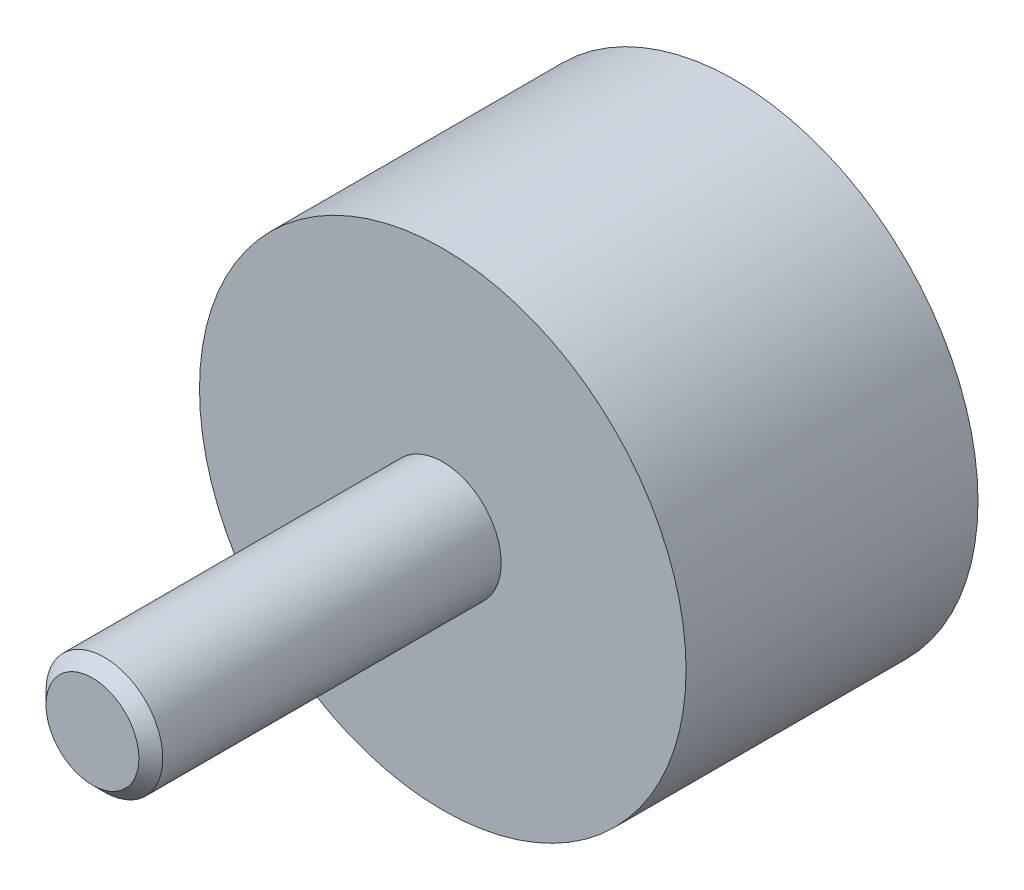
ISO-10303-21;
HEADER;
FILE_DESCRIPTION(('STEP AP214'),'2;1');
FILE_NAME('part.step','',(''),(''),'','','');
FILE_SCHEMA(('AUTOMOTIVE_DESIGN { 1 0 10303 214 1 1 1 1 }'));
ENDSEC;
DATA;
#1=APPLICATION_CONTEXT('core data for automotive mechanical design processes');
#2=APPLICATION_PROTOCOL_DEFINITION('international standard','automotive_design',2000,#1);
#3=PRODUCT_CONTEXT('',#1,'mechanical');
#4=PRODUCT('Part','Part','',(#3));
#5=PRODUCT_RELATED_PRODUCT_CATEGORY('part','',(#4));
#6=PRODUCT_DEFINITION_FORMATION('','',#4);
#7=PRODUCT_DEFINITION_CONTEXT('part definition',#1,'design');
#8=PRODUCT_DEFINITION('design','',#6,#7);
#9=PRODUCT_DEFINITION_SHAPE('','',#8);
#10=(LENGTH_UNIT() NAMED_UNIT(*) SI_UNIT(.MILLI.,.METRE.));
#11=(NAMED_UNIT(*) PLANE_ANGLE_UNIT() SI_UNIT($,.RADIAN.));
#12=(NAMED_UNIT(*) SI_UNIT($,.STERADIAN.) SOLID_ANGLE_UNIT());
#13=UNCERTAINTY_MEASURE_WITH_UNIT(LENGTH_MEASURE(1.E-05),#10,'distance_accuracy_value','');
#14=(GEOMETRIC_REPRESENTATION_CONTEXT(3) GLOBAL_UNCERTAINTY_ASSIGNED_CONTEXT((#13)) GLOBAL_UNIT_ASSIGNED_CONTEXT((#10,
#11,#12)) REPRESENTATION_CONTEXT('',''));
#15=CARTESIAN_POINT('',(0.,0.,0.));
#16=DIRECTION('',(0.,0.,1.));
#17=DIRECTION('',(1.,0.,0.));
#18=AXIS2_PLACEMENT_3D('',#15,#16,#17);
#19=CARTESIAN_POINT('',(11.666666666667,0.,15.));
#20=DIRECTION('',(0.,0.,1.));
#21=DIRECTION('',(0.,-1.,0.));
#22=AXIS2_PLACEMENT_3D('',#19,#20,#21);
#23=PLANE('',#22);
#24=CARTESIAN_POINT('',(0.,0.,15.));
#25=DIRECTION('',(0.,0.,1.));
#26=DIRECTION('',(0.,-1.,0.));
#27=AXIS2_PLACEMENT_3D('',#24,#25,#26);
#28=CIRCLE('',#27,3.);
#29=CARTESIAN_POINT('',(0.,-3.,15.));
#30=VERTEX_POINT('',#29);
#31=EDGE_CURVE('E23',#30,#30,#28,.T.);
#32=ORIENTED_EDGE('',*,*,#31,.F.);
#33=EDGE_LOOP('',(#32));
#34=FACE_BOUND('',#33,.T.);
#35=CARTESIAN_POINT('',(0.,0.,15.));
#36=DIRECTION('',(0.,0.,1.));
#37=DIRECTION('',(0.,-1.,0.));
#38=AXIS2_PLACEMENT_3D('',#35,#36,#37);
#39=CIRCLE('',#38,12.5);
#40=CARTESIAN_POINT('',(0.,-12.5,15.));
#41=VERTEX_POINT('',#40);
#42=EDGE_CURVE('E27',#41,#41,#39,.T.);
#43=ORIENTED_EDGE('',*,*,#42,.T.);
#44=EDGE_LOOP('',(#43));
#45=FACE_BOUND('',#44,.T.);
#46=ADVANCED_FACE('F12',(#34,#45),#23,.T.);
#47=CARTESIAN_POINT('',(0.,0.,0.5));
#48=DIRECTION('',(0.,0.,1.));
#49=DIRECTION('',(0.,-1.,0.));
#50=AXIS2_PLACEMENT_3D('',#47,#48,#49);
#51=CYLINDRICAL_SURFACE('',#50,12.5);
#52=CARTESIAN_POINT('',(0.,0.,0.));
#53=DIRECTION('',(0.,0.,1.));
#54=DIRECTION('',(0.,-1.,0.));
#55=AXIS2_PLACEMENT_3D('',#52,#53,#54);
#56=CIRCLE('',#55,12.5);
#57=CARTESIAN_POINT('',(0.,-12.5,0.));
#58=VERTEX_POINT('',#57);
#59=EDGE_CURVE('E32',#58,#58,#56,.T.);
#60=ORIENTED_EDGE('',*,*,#59,.T.);
#61=EDGE_LOOP('',(#60));
#62=FACE_BOUND('',#61,.T.);
#63=ORIENTED_EDGE('',*,*,#42,.F.);
#64=EDGE_LOOP('',(#63));
#65=FACE_BOUND('',#64,.T.);
#66=ADVANCED_FACE('F63',(#62,#65),#51,.T.);
#67=CARTESIAN_POINT('',(12.5,0.,0.));
#68=DIRECTION('',(0.,0.,-1.));
#69=DIRECTION('',(0.,1.,0.));
#70=AXIS2_PLACEMENT_3D('',#67,#68,#69);
#71=PLANE('',#70);
#72=CARTESIAN_POINT('',(0.,0.,0.));
#73=DIRECTION('',(0.,0.,-1.));
#74=DIRECTION('',(0.,1.,0.));
#75=AXIS2_PLACEMENT_3D('',#72,#73,#74);
#76=CIRCLE('',#75,3.45);
#77=CARTESIAN_POINT('',(0.,3.45,0.));
#78=VERTEX_POINT('',#77);
#79=EDGE_CURVE('E8',#78,#78,#76,.F.);
#80=ORIENTED_EDGE('',*,*,#79,.T.);
#81=EDGE_LOOP('',(#80));
#82=FACE_BOUND('',#81,.T.);
#83=ORIENTED_EDGE('',*,*,#59,.F.);
#84=EDGE_LOOP('',(#83));
#85=FACE_BOUND('',#84,.T.);
#86=ADVANCED_FACE('F68',(#82,#85),#71,.T.);
#87=CARTESIAN_POINT('',(0.,0.,33.));
#88=DIRECTION('',(0.,0.,1.));
#89=DIRECTION('',(0.,-1.,0.));
#90=AXIS2_PLACEMENT_3D('',#87,#88,#89);
#91=PLANE('',#90);
#92=CARTESIAN_POINT('',(0.,0.,33.));
#93=DIRECTION('',(0.,0.,1.));
#94=DIRECTION('',(0.,-1.,0.));
#95=AXIS2_PLACEMENT_3D('',#92,#93,#94);
#96=CIRCLE('',#95,2.3865);
#97=CARTESIAN_POINT('',(0.,-2.3865,33.));
#98=VERTEX_POINT('',#97);
#99=EDGE_CURVE('E35',#98,#98,#96,.T.);
#100=ORIENTED_EDGE('',*,*,#99,.T.);
#101=EDGE_LOOP('',(#100));
#102=FACE_BOUND('',#101,.T.);
#103=ADVANCED_FACE('F74',(#102),#91,.T.);
#104=CARTESIAN_POINT('',(0.,0.,33.));
#105=DIRECTION('',(0.,0.,-1.));
#106=DIRECTION('',(0.,1.,0.));
#107=AXIS2_PLACEMENT_3D('',#104,#105,#106);
#108=CONICAL_SURFACE('',#107,2.3865,0.785398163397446);
#109=CARTESIAN_POINT('',(0.,0.,32.3865));
#110=DIRECTION('',(0.,0.,1.));
#111=DIRECTION('',(0.,-1.,0.));
#112=AXIS2_PLACEMENT_3D('',#109,#110,#111);
#113=CIRCLE('',#112,3.);
#114=CARTESIAN_POINT('',(0.,-3.,32.3865));
#115=VERTEX_POINT('',#114);
#116=EDGE_CURVE('E38',#115,#115,#113,.T.);
#117=ORIENTED_EDGE('',*,*,#116,.T.);
#118=EDGE_LOOP('',(#117));
#119=FACE_BOUND('',#118,.T.);
#120=ORIENTED_EDGE('',*,*,#99,.F.);
#121=EDGE_LOOP('',(#120));
#122=FACE_BOUND('',#121,.T.);
#123=ADVANCED_FACE('F57',(#119,#122),#108,.T.);
#124=CARTESIAN_POINT('',(0.,0.,15.));
#125=DIRECTION('',(0.,0.,1.));
#126=DIRECTION('',(0.,-1.,0.));
#127=AXIS2_PLACEMENT_3D('',#124,#125,#126);
#128=CYLINDRICAL_SURFACE('',#127,3.);
#129=ORIENTED_EDGE('',*,*,#31,.T.);
#130=EDGE_LOOP('',(#129));
#131=FACE_BOUND('',#130,.T.);
#132=ORIENTED_EDGE('',*,*,#116,.F.);
#133=EDGE_LOOP('',(#132));
#134=FACE_BOUND('',#133,.T.);
#135=ADVANCED_FACE('F49',(#131,#134),#128,.T.);
#136=CARTESIAN_POINT('',(0.,0.,0.));
#137=DIRECTION('',(0.,0.,1.));
#138=DIRECTION('',(0.,-1.,0.));
#139=AXIS2_PLACEMENT_3D('',#136,#137,#138);
#140=CYLINDRICAL_SURFACE('',#139,3.);
#141=CARTESIAN_POINT('',(0.,0.,0.45));
#142=DIRECTION('',(0.,0.,-1.));
#143=DIRECTION('',(0.,1.,0.));
#144=AXIS2_PLACEMENT_3D('',#141,#142,#143);
#145=CIRCLE('',#144,3.);
#146=CARTESIAN_POINT('',(0.,3.,0.45));
#147=VERTEX_POINT('',#146);
#148=EDGE_CURVE('E19',#147,#147,#145,.T.);
#149=ORIENTED_EDGE('',*,*,#148,.T.);
#150=EDGE_LOOP('',(#149));
#151=FACE_BOUND('',#150,.T.);
#152=CARTESIAN_POINT('',(0.,0.,6.));
#153=DIRECTION('',(0.,0.,-1.));
#154=DIRECTION('',(0.,1.,0.));
#155=AXIS2_PLACEMENT_3D('',#152,#153,#154);
#156=CIRCLE('',#155,3.);
#157=CARTESIAN_POINT('',(0.,3.,6.));
#158=VERTEX_POINT('',#157);
#159=EDGE_CURVE('E41',#158,#158,#156,.T.);
#160=ORIENTED_EDGE('',*,*,#159,.F.);
#161=EDGE_LOOP('',(#160));
#162=FACE_BOUND('',#161,.T.);
#163=ADVANCED_FACE('F47',(#151,#162),#140,.F.);
#164=CARTESIAN_POINT('',(0.,0.,6.));
#165=DIRECTION('',(0.,0.,-1.));
#166=DIRECTION('',(0.,1.,0.));
#167=AXIS2_PLACEMENT_3D('',#164,#165,#166);
#168=PLANE('',#167);
#169=ORIENTED_EDGE('',*,*,#159,.T.);
#170=EDGE_LOOP('',(#169));
#171=FACE_BOUND('',#170,.T.);
#172=ADVANCED_FACE('F45',(#171),#168,.T.);
#173=CARTESIAN_POINT('',(0.,0.,0.45));
#174=DIRECTION('',(0.,0.,-1.));
#175=DIRECTION('',(0.,1.,0.));
#176=AXIS2_PLACEMENT_3D('',#173,#174,#175);
#177=CONICAL_SURFACE('',#176,3.,0.785398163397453);
#178=ORIENTED_EDGE('',*,*,#79,.F.);
#179=EDGE_LOOP('',(#178));
#180=FACE_BOUND('',#179,.T.);
#181=ORIENTED_EDGE('',*,*,#148,.F.);
#182=EDGE_LOOP('',(#181));
#183=FACE_BOUND('',#182,.T.);
#184=ADVANCED_FACE('F14',(#180,#183),#177,.F.);
#185=CLOSED_SHELL('',(#46,#66,#86,#103,#123,#135,#163,#172,#184));
#186=MANIFOLD_SOLID_BREP('B1',#185);
#187=ADVANCED_BREP_SHAPE_REPRESENTATION('',(#18,#186),#14);
#188=SHAPE_DEFINITION_REPRESENTATION(#9,#187);
ENDSEC;
END-ISO-10303-21;
